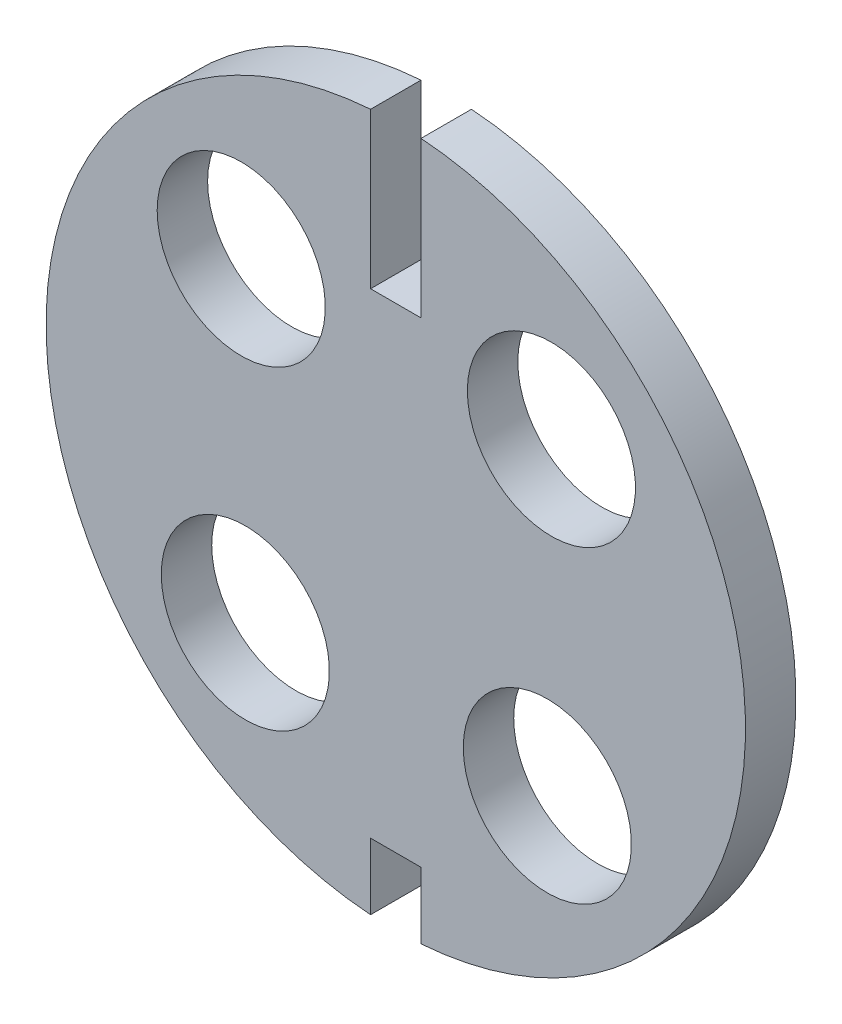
from build123d import *

# Parameters (mm, degrees)
SKETCH1_R          = 26.416
EXTRUDE1_DEPTH     = 3.81
SKETCH2_R          = 6.35
CUT_EXTRUDE1_DEPTH = 38.551647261
SKETCH3_W          = 3.81
SKETCH3_H          = 12.814564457
SKETCH3_H_2        = 6.587446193
CUT_EXTRUDE2_DEPTH = 38.551647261


with BuildPart() as part:
    # Sketch1 → Extrude1 (new body)
    with BuildSketch(Plane.XY):
        with Locations(Location((0, 0, 0), (0, 0, 180))):
            Circle(SKETCH1_R)
    extrude(amount=EXTRUDE1_DEPTH)

    # Sketch2 → Cut-Extrude1 (cut, through all)
    with BuildSketch(Plane.XY):
        with Locations(Location((-11.674332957, 11.674332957, 0), (0, 0, 180))):
            Circle(SKETCH2_R)
        with Locations(Location((11.756888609, 11.591189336, 0), (0, 0, 180))):
            Circle(SKETCH2_R)
        with Locations(Location((11.448903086, -11.895491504, 0), (0, 0, 180))):
            Circle(SKETCH2_R)
        with Locations(Location((-11.364280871, -11.976360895, 0), (0, 0, 180))):
            Circle(SKETCH2_R)
    extrude(amount=CUT_EXTRUDE1_DEPTH, mode=Mode.SUBTRACT)

    # Sketch3 → Cut-Extrude2 (cut, through all)
    with BuildSketch(Plane.XY):
        with Locations((0, 21.012282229)):
            Rectangle(SKETCH3_W, SKETCH3_H)
        with Locations((0, -24.629723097)):
            Rectangle(SKETCH3_W, SKETCH3_H_2)
    extrude(amount=CUT_EXTRUDE2_DEPTH, mode=Mode.SUBTRACT)


solid = part.part
